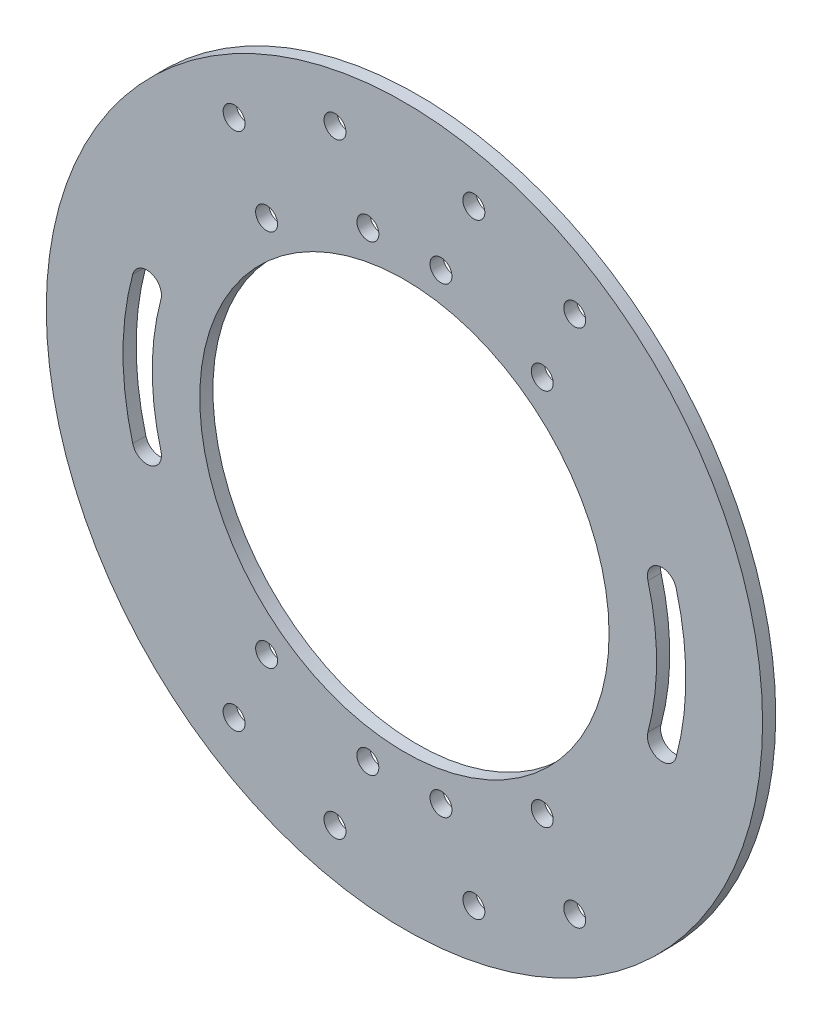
from build123d import *

# Parameters (mm, degrees)
ESQUISSE1_R                  = 49
ESQUISSE1_R_2                = 28
ESQUISSE1_R_3                = 1.5
EXTRUSION1_DEPTH             = 1.8
ENL_V_MAT_EXTRU_1_DEPTH      = 1.8
R_P_TITION_CIRCULAIRE1_COUNT = 2


with BuildPart() as part:
    # Esquisse1 → Extrusion1 (new body)
    with BuildSketch(Plane.XY):
        Circle(ESQUISSE1_R)
        Circle(ESQUISSE1_R_2, mode=Mode.SUBTRACT)
        with Locations((-5, 31.606961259)):
            Circle(ESQUISSE1_R_3, mode=Mode.SUBTRACT)
        with Locations((-18.853772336, 25.856048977)):
            Circle(ESQUISSE1_R_3, mode=Mode.SUBTRACT)
        with Locations((-9.5, 41.424630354)):
            Circle(ESQUISSE1_R_3, mode=Mode.SUBTRACT)
        with Locations((-23.299307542, 35.544229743)):
            Circle(ESQUISSE1_R_3, mode=Mode.SUBTRACT)
        with Locations(Location((23.299307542, 35.544229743, 0), (0, 0, 180))):
            Circle(ESQUISSE1_R_3, mode=Mode.SUBTRACT)
        with Locations(Location((9.5, 41.424630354, 0), (0, 0, 180))):
            Circle(ESQUISSE1_R_3, mode=Mode.SUBTRACT)
        with Locations(Location((18.853772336, 25.856048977, 0), (0, 0, 180))):
            Circle(ESQUISSE1_R_3, mode=Mode.SUBTRACT)
        with Locations(Location((5, 31.606961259, 0), (0, 0, 180))):
            Circle(ESQUISSE1_R_3, mode=Mode.SUBTRACT)
        with Locations((5, -31.606961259)):
            Circle(ESQUISSE1_R_3, mode=Mode.SUBTRACT)
        with Locations((18.853772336, -25.856048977)):
            Circle(ESQUISSE1_R_3, mode=Mode.SUBTRACT)
        with Locations((9.5, -41.424630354)):
            Circle(ESQUISSE1_R_3, mode=Mode.SUBTRACT)
        with Locations((23.299307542, -35.544229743)):
            Circle(ESQUISSE1_R_3, mode=Mode.SUBTRACT)
        with Locations(Location((-23.299307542, -35.544229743, 0), (0, 0, 180))):
            Circle(ESQUISSE1_R_3, mode=Mode.SUBTRACT)
        with Locations(Location((-9.5, -41.424630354, 0), (0, 0, 180))):
            Circle(ESQUISSE1_R_3, mode=Mode.SUBTRACT)
        with Locations(Location((-18.853772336, -25.856048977, 0), (0, 0, 180))):
            Circle(ESQUISSE1_R_3, mode=Mode.SUBTRACT)
        with Locations(Location((-5, -31.606961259, 0), (0, 0, 180))):
            Circle(ESQUISSE1_R_3, mode=Mode.SUBTRACT)
    extrude(amount=EXTRUSION1_DEPTH)

    # Esquisse3 → Enl_v. mat.-Extru.1 (cut)
    with BuildSketch(Plane.XY.offset(1.8)):
        with BuildLine():
            ThreePointArc((-33.310950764, 8.979452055), (-34.5, 0), (-33.310950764, -8.979452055))
            ThreePointArc((-33.310950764, -8.979452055), (-34.721472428, -11.43106961), (-37.173089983, -10.020547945))
            ThreePointArc((-37.173089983, -10.020547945), (-38.5, 0), (-37.173089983, 10.020547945))
            ThreePointArc((-37.173089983, 10.020547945), (-34.721472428, 11.43106961), (-33.310950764, 8.979452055))
        make_face()
    enl_v_mat_extru_1 = extrude(amount=-ENL_V_MAT_EXTRU_1_DEPTH, mode=Mode.SUBTRACT)

    # R_p_tition circulaire1: Enl_v. mat.-Extru.1 ×2 about axis
    r_p_tition_circulaire1_axis = Axis((0, 0, 0), (0, 0, 1))
    for i in range(1, R_P_TITION_CIRCULAIRE1_COUNT):
        add(enl_v_mat_extru_1.rotate(r_p_tition_circulaire1_axis, i * 360 / R_P_TITION_CIRCULAIRE1_COUNT), mode=Mode.SUBTRACT)


solid = part.part
